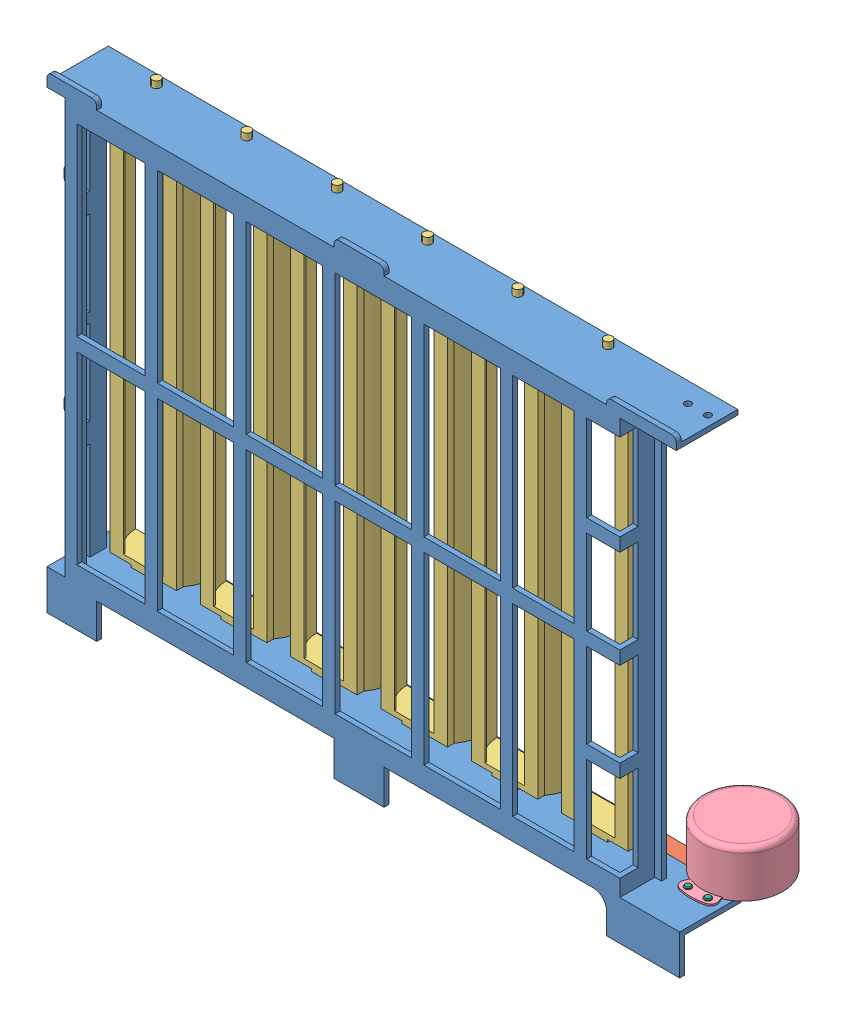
SolidWorks assembly Panier_Oeuf.SLDASM, configuration Défaut (file format 5000). Lengths in mm.
Overall size (406 282 78).
13 component instances, 7 part files, 33 mates.
Components (placement in the parent):
- Chassis-1: Chassis.SLDPRT [Défaut] at origin size (396 282 37)
- Bielle-1: Bielle.SLDPRT [Défaut] at (230.8573 -79.1614 -94.1147) x (-1 0 0) z (0 -1 0) size (334 44 9)
- Support_oeufs-1: Support_oeufs.SLDPRT [Défaut] at (-63.453 59.8386 -37) x (-1 0 0.00027) z (0 1 0) size (49 34 280.5)
- Support_oeufs-2: Support_oeufs.SLDPRT [Défaut] at (-9.053 59.8386 -37) x (-1 0 0.00027) z (0 1 0) size (49 34 280.5)
- Support_oeufs-3: Support_oeufs.SLDPRT [Défaut] at (45.347 59.8386 -37) x (-1 0 0.00027) z (0 1 0) size (49 34 280.5)
- Support_oeufs-4: Support_oeufs.SLDPRT [Défaut] at (99.747 59.8386 -37) x (-1 0 0.00027) z (0 1 0) size (49 34 280.5)
- Support_oeufs-5: Support_oeufs.SLDPRT [Défaut] at (154.147 59.8386 -37) x (-1 0 0.00027) z (0 1 0) size (49 34 280.5)
- Support_oeufs-6: Support_oeufs.SLDPRT [Défaut] at (208.547 59.8386 -37) x (-1 0 0.00027) z (0 1 0) size (49 34 280.5)
- Moteur-1: Moteur.SLDPRT [Défaut] at (268.5494 -37.1614 -49) x (-1 0 0) z (0 -1 0) size (48 55.25 30)
- Manivelle-1: Manivelle.SLDPRT [Défaut] at (256.5494 -67.6614 -49) x (0.997415 0 -0.071853) z (0 -1 0) size (12 24 16)
- Vis-1: Vis.SLDPRT [Défaut] at (274.5494 -68.1614 -22) x (-0.990019 0 -0.140935) z (0 1 0) size (8 8 8)
- Vis-2: Vis.SLDPRT [Défaut] at (262.5494 -68.1614 -22) x (-0.990019 0 -0.140935) z (0 1 0) size (8 8 8)
- Bague-2: Bague.SLDPRT [Défaut] at (255.5435 -75.1614 -62.9638) x (0.897068 0 0.441893) z (0 1 0) size (5.36 5.36 2)
Mates (geometry in assembly coordinates):
- Coaxiale14: concentric anti-aligned: cylinder of Chassis-1 through (208.5494 192.8386 -28) axis (0 -1 0) radius 2.5; cylinder of Support_oeufs-6 through (208.5494 -71.1614 -28) axis (0 1 0) radius 2.5
- Distance9: distance = 2 mm anti-aligned: plane of Support_oeufs-6 through (208.547 -63.1614 -37) normal (0 -1 0); plane of Chassis-1 through (282.5494 -65.1614 3) normal (0 1 0)
- Coaxiale16: concentric anti-aligned: cylinder of Chassis-1 through (154.1494 192.8386 -28) axis (0 -1 0) radius 2.5; cylinder of Support_oeufs-5 through (154.1494 -71.1614 -28) axis (0 1 0) radius 2.5
- Distance11: distance = 2 mm anti-aligned: plane of Support_oeufs-5 through (154.147 -63.1614 -37) normal (0 -1 0); plane of Chassis-1 through (282.5494 -65.1614 3) normal (0 1 0)
- Coaxiale18: concentric anti-aligned: cylinder of Chassis-1 through (99.7494 192.8386 -28) axis (0 -1 0) radius 2.5; cylinder of Support_oeufs-4 through (99.7494 -71.1614 -28) axis (0 1 0) radius 2.5
- Distance12: distance = 2 mm anti-aligned: plane of Support_oeufs-4 through (99.747 -63.1614 -37) normal (0 -1 0); plane of Chassis-1 through (282.5494 -65.1614 3) normal (0 1 0)
- Coaxiale20: concentric anti-aligned: cylinder of Chassis-1 through (45.3494 192.8386 -28) axis (0 -1 0) radius 2.5; cylinder of Support_oeufs-3 through (45.3494 -71.1614 -28) axis (0 1 0) radius 2.5
- Coïncidente14: coincident anti-aligned: circle of Chassis-1; cylinder of Support_oeufs-2 through (-9.0506 -71.1614 -28) axis (0 1 0) radius 2.5
- Coaxiale21: concentric anti-aligned: cylinder of Chassis-1 through (-63.4506 192.8386 -28) axis (0 -1 0) radius 2.5; cylinder of Support_oeufs-1 through (-63.4506 -71.1614 -28) axis (0 1 0) radius 2.5
- Distance13: distance = 2 mm anti-aligned: plane of Support_oeufs-3 through (45.347 -63.1614 -37) normal (0 -1 0); plane of Chassis-1 through (282.5494 -65.1614 3) normal (0 1 0)
- Distance14: distance = 2 mm anti-aligned: plane of Support_oeufs-2 through (-9.053 -63.1614 -37) normal (0 -1 0); plane of Chassis-1 through (282.5494 -65.1614 3) normal (0 1 0)
- Distance15: distance = 2 mm anti-aligned: plane of Support_oeufs-1 through (-63.453 -63.1614 -37) normal (0 -1 0); plane of Chassis-1 through (282.5494 -65.1614 3) normal (0 1 0)
- Coaxiale25: concentric aligned: cylinder of Moteur-1 through (256.5494 -57.1614 -49) axis (0 -1 0) radius 3; cylinder of Manivelle-1 through (256.5494 -60.6614 -49) axis (0 -1 0) radius 3
- Distance16: distance = 0.5 mm anti-aligned: plane of Moteur-1 through (256.5494 -67.1614 -49) normal (0 -1 0); plane of Manivelle-1 through (256.5494 -67.6614 -49) normal (0 1 0)
- Coïncidente19: coincident anti-aligned: plane of Chassis-1 through (282.5494 -65.1614 3) normal (0 1 0); plane of Moteur-1 through (268.5494 -65.1614 -49) normal (0 -1 0)
- Coaxiale26: concentric aligned: cylinder of Chassis-1 through (274.5494 192.8386 -22) axis (0 -1 0) radius 2; cylinder of Moteur-1 through (274.5494 -64.1614 -22) axis (0 -1 0) radius 2
- Coaxiale27: concentric aligned: cylinder of Chassis-1 through (262.5494 192.8386 -22) axis (0 -1 0) radius 2; cylinder of Moteur-1 through (262.5494 -64.1614 -22) axis (0 -1 0) radius 2
- Coaxiale28: concentric aligned: cylinder of Chassis-1 through (274.5494 192.8386 -22) axis (0 -1 0) radius 2; cylinder of Vis-1 through (274.5494 -63.1614 -22) axis (0 -1 0) radius 2
- Coïncidente20: coincident anti-aligned: plane of Chassis-1 through (104.5494 -68.1614 3) normal (0 -1 0); plane of Vis-1 through (274.5494 -68.1614 -22) normal (0 1 0)
- Coaxiale29: concentric aligned: cylinder of Chassis-1 through (262.5494 192.8386 -22) axis (0 -1 0) radius 2; cylinder of Vis-2 through (262.5494 -63.1614 -22) axis (0 -1 0) radius 2
- Coïncidente21: coincident anti-aligned: plane of Chassis-1 through (104.5494 -68.1614 3) normal (0 -1 0); plane of Vis-2 through (262.5494 -68.1614 -22) normal (0 1 0)
- Parallèle1: parallel anti-aligned: plane of Chassis-1 through (104.5494 -68.1614 3) normal (0 -1 0); plane of Bielle-1 through (242.5435 -79.1614 -64) normal (0 1 0)
- Coaxiale33: concentric anti-aligned: cylinder of Manivelle-1 through (255.5435 -75.6614 -62.9638) axis (0 1 0) radius 2; cylinder of Bague-2 through (255.5435 -73.1614 -62.9638) axis (0 -1 0) radius 1
- Coïncidente35: coincident anti-aligned: plane of Bielle-1 through (253.5435 -73.1614 -31) normal (1 0 0); plane of Bague-2 through (253.5435 -73.1614 -64.9638) normal (-1 0 0)
- Coïncidente36: coincident anti-aligned: plane of Bielle-1 through (253.5435 -73.1614 -31) normal (1 0 0); plane of Bague-2 through (253.5435 -73.1614 -64.9638) normal (-1 0 0)
- Coïncidente37: coincident aligned: plane of Bielle-1 through (251.5435 -75.1614 -31) normal (0 -1 0); plane of Bague-2 through (255.5435 -75.1614 -62.9638) normal (0 -1 0)
- Coïncidente38: coincident anti-aligned: plane of Manivelle-1 through (256.5494 -73.1614 -49) normal (0 -1 0); plane of Bague-2 through (255.5435 -73.1614 -62.9638) normal (0 1 0)
- Coïncidente64: coincident aligned: line of Bielle-1 through (208.5435 -79.1614 -50) axis (0 -1 0); line of Support_oeufs-6 through (208.5435 -71.8741 -50) axis (0 -1 0)
- Coïncidente65: coincident aligned: line of Bielle-1 through (154.1435 -79.1614 -50) axis (0 -1 0); line of Support_oeufs-5 through (154.1435 -71.8741 -50) axis (0 -1 0)
- Coïncidente66: coincident aligned: line of Bielle-1 through (99.7435 -79.1614 -50) axis (0 -1 0); line of Support_oeufs-4 through (99.7435 -71.8741 -50) axis (0 -1 0)
- Coïncidente67: coincident aligned: line of Bielle-1 through (45.3435 -79.1614 -50) axis (0 -1 0); line of Support_oeufs-3 through (45.3435 -71.8741 -50) axis (0 -1 0)
- Coïncidente68: coincident aligned: line of Bielle-1 through (-9.0565 -79.1614 -50) axis (0 -1 0); line of Support_oeufs-2 through (-9.0565 -71.8741 -50) axis (0 -1 0)
- Coïncidente69: coincident aligned: line of Bielle-1 through (-63.4565 -79.1614 -50) axis (0 -1 0); line of Support_oeufs-1 through (-63.4565 -71.8741 -50) axis (0 -1 0)
